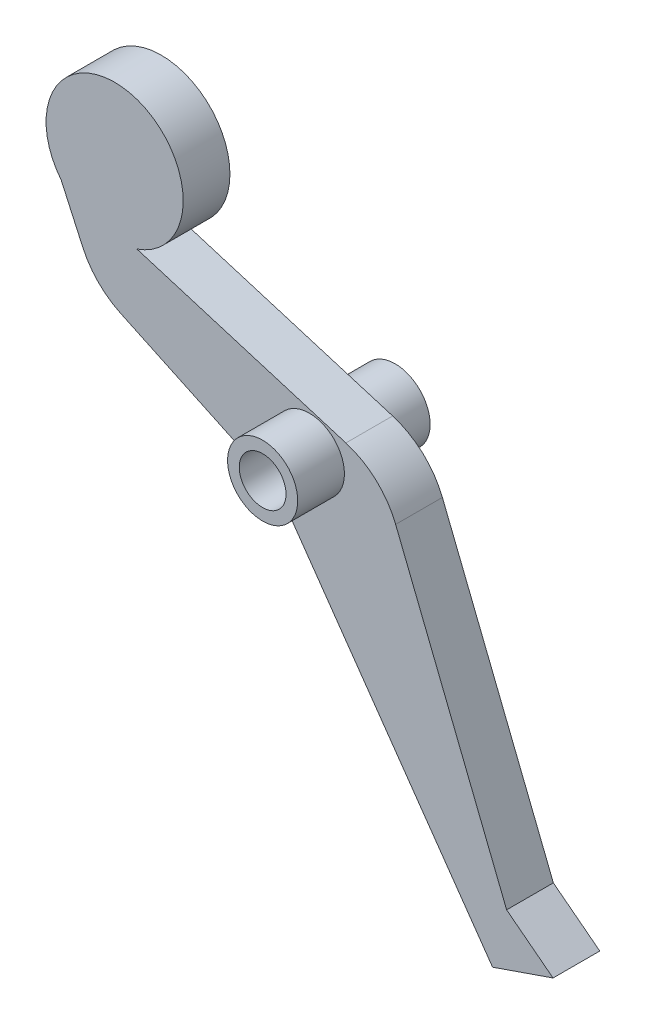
ISO-10303-21;
HEADER;
FILE_DESCRIPTION(('STEP AP214'),'2;1');
FILE_NAME('part.step','',(''),(''),'','','');
FILE_SCHEMA(('AUTOMOTIVE_DESIGN { 1 0 10303 214 1 1 1 1 }'));
ENDSEC;
DATA;
#1=APPLICATION_CONTEXT('core data for automotive mechanical design processes');
#2=APPLICATION_PROTOCOL_DEFINITION('international standard','automotive_design',2000,#1);
#3=PRODUCT_CONTEXT('',#1,'mechanical');
#4=PRODUCT('Part','Part','',(#3));
#5=PRODUCT_RELATED_PRODUCT_CATEGORY('part','',(#4));
#6=PRODUCT_DEFINITION_FORMATION('','',#4);
#7=PRODUCT_DEFINITION_CONTEXT('part definition',#1,'design');
#8=PRODUCT_DEFINITION('design','',#6,#7);
#9=PRODUCT_DEFINITION_SHAPE('','',#8);
#10=(LENGTH_UNIT() NAMED_UNIT(*) SI_UNIT(.MILLI.,.METRE.));
#11=(NAMED_UNIT(*) PLANE_ANGLE_UNIT() SI_UNIT($,.RADIAN.));
#12=(NAMED_UNIT(*) SI_UNIT($,.STERADIAN.) SOLID_ANGLE_UNIT());
#13=UNCERTAINTY_MEASURE_WITH_UNIT(LENGTH_MEASURE(1.E-05),#10,'distance_accuracy_value','');
#14=(GEOMETRIC_REPRESENTATION_CONTEXT(3) GLOBAL_UNCERTAINTY_ASSIGNED_CONTEXT((#13)) GLOBAL_UNIT_ASSIGNED_CONTEXT((#10,
#11,#12)) REPRESENTATION_CONTEXT('',''));
#15=CARTESIAN_POINT('',(0.,0.,0.));
#16=DIRECTION('',(0.,0.,1.));
#17=DIRECTION('',(1.,0.,0.));
#18=AXIS2_PLACEMENT_3D('',#15,#16,#17);
#19=CARTESIAN_POINT('',(176.30998455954,-47.4739661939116,-6.));
#20=DIRECTION('',(0.32629419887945,-0.945268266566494,0.));
#21=DIRECTION('',(0.945268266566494,0.32629419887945,0.));
#22=AXIS2_PLACEMENT_3D('',#19,#20,#21);
#23=PLANE('',#22);
#24=DIRECTION('',(0.945268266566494,0.32629419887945,0.));
#25=VECTOR('',#24,1.);
#26=CARTESIAN_POINT('',(176.30998455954,-47.4739661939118,0.));
#27=LINE('',#26,#25);
#28=CARTESIAN_POINT('',(176.30998455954,-47.4739661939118,0.));
#29=VERTEX_POINT('',#28);
#30=CARTESIAN_POINT('',(184.073286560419,-44.7941762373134,0.));
#31=VERTEX_POINT('',#30);
#32=EDGE_CURVE('E746',#29,#31,#27,.T.);
#33=ORIENTED_EDGE('',*,*,#32,.F.);
#34=DIRECTION('',(0.,0.,0.999999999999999));
#35=VECTOR('',#34,1.);
#36=CARTESIAN_POINT('',(176.30998455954,-47.4739661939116,-6.));
#37=LINE('',#36,#35);
#38=CARTESIAN_POINT('',(176.30998455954,-47.4739661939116,-6.));
#39=VERTEX_POINT('',#38);
#40=EDGE_CURVE('E669',#39,#29,#37,.T.);
#41=ORIENTED_EDGE('',*,*,#40,.F.);
#42=DIRECTION('',(0.945268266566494,0.32629419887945,0.));
#43=VECTOR('',#42,1.);
#44=CARTESIAN_POINT('',(176.30998455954,-47.4739661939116,-6.));
#45=LINE('',#44,#43);
#46=CARTESIAN_POINT('',(184.073286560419,-44.7941762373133,-6.));
#47=VERTEX_POINT('',#46);
#48=EDGE_CURVE('E748',#39,#47,#45,.T.);
#49=ORIENTED_EDGE('',*,*,#48,.T.);
#50=DIRECTION('',(0.,0.,0.999999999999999));
#51=VECTOR('',#50,1.);
#52=CARTESIAN_POINT('',(184.073286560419,-44.7941762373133,-6.));
#53=LINE('',#52,#51);
#54=EDGE_CURVE('E743',#47,#31,#53,.T.);
#55=ORIENTED_EDGE('',*,*,#54,.T.);
#56=EDGE_LOOP('',(#33,#41,#49,#55));
#57=FACE_BOUND('',#56,.T.);
#58=ADVANCED_FACE('F661',(#57),#23,.T.);
#59=CARTESIAN_POINT('',(150.322061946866,-10.353529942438,-6.));
#60=DIRECTION('',(-0.819194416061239,-0.573515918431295,0.));
#61=DIRECTION('',(0.573515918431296,-0.819194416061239,0.));
#62=AXIS2_PLACEMENT_3D('',#59,#60,#61);
#63=PLANE('',#62);
#64=DIRECTION('',(0.573515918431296,-0.819194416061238,0.));
#65=VECTOR('',#64,1.);
#66=CARTESIAN_POINT('',(150.322061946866,-10.3535299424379,0.));
#67=LINE('',#66,#65);
#68=CARTESIAN_POINT('',(150.322061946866,-10.3535299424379,0.));
#69=VERTEX_POINT('',#68);
#70=EDGE_CURVE('E764',#69,#29,#67,.T.);
#71=ORIENTED_EDGE('',*,*,#70,.F.);
#72=DIRECTION('',(0.,0.,0.999999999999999));
#73=VECTOR('',#72,1.);
#74=CARTESIAN_POINT('',(150.322061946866,-10.353529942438,-6.));
#75=LINE('',#74,#73);
#76=CARTESIAN_POINT('',(150.322061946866,-10.353529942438,-6.));
#77=VERTEX_POINT('',#76);
#78=EDGE_CURVE('E684',#77,#69,#75,.T.);
#79=ORIENTED_EDGE('',*,*,#78,.F.);
#80=DIRECTION('',(0.573515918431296,-0.819194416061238,0.));
#81=VECTOR('',#80,1.);
#82=CARTESIAN_POINT('',(150.322061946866,-10.353529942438,-6.));
#83=LINE('',#82,#81);
#84=EDGE_CURVE('E753',#77,#39,#83,.T.);
#85=ORIENTED_EDGE('',*,*,#84,.T.);
#86=ORIENTED_EDGE('',*,*,#40,.T.);
#87=EDGE_LOOP('',(#71,#79,#85,#86));
#88=FACE_BOUND('',#87,.T.);
#89=ADVANCED_FACE('F866',(#88),#63,.T.);
#90=CARTESIAN_POINT('',(142.130117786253,-16.0886891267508,-5.99999999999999));
#91=DIRECTION('',(0.,0.,0.999999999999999));
#92=DIRECTION('',(1.,0.,0.));
#93=AXIS2_PLACEMENT_3D('',#90,#91,#92);
#94=CYLINDRICAL_SURFACE('',#93,9.99999999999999);
#95=CARTESIAN_POINT('',(142.130117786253,-16.0886891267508,0.));
#96=DIRECTION('',(0.,0.,-0.999999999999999));
#97=DIRECTION('',(1.,0.,0.));
#98=AXIS2_PLACEMENT_3D('',#95,#96,#97);
#99=CIRCLE('',#98,9.99999999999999);
#100=CARTESIAN_POINT('',(146.385172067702,-7.03913040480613,0.));
#101=VERTEX_POINT('',#100);
#102=EDGE_CURVE('E789',#101,#69,#99,.T.);
#103=ORIENTED_EDGE('',*,*,#102,.F.);
#104=DIRECTION('',(0.,0.,0.999999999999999));
#105=VECTOR('',#104,1.);
#106=CARTESIAN_POINT('',(146.385172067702,-7.03913040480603,-6.));
#107=LINE('',#106,#105);
#108=CARTESIAN_POINT('',(146.385172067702,-7.03913040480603,-6.));
#109=VERTEX_POINT('',#108);
#110=EDGE_CURVE('E821',#109,#101,#107,.T.);
#111=ORIENTED_EDGE('',*,*,#110,.F.);
#112=CARTESIAN_POINT('',(142.130117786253,-16.0886891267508,-5.99999999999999));
#113=DIRECTION('',(0.,0.,-0.999999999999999));
#114=DIRECTION('',(1.,0.,0.));
#115=AXIS2_PLACEMENT_3D('',#112,#113,#114);
#116=CIRCLE('',#115,9.99999999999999);
#117=EDGE_CURVE('E816',#109,#77,#116,.T.);
#118=ORIENTED_EDGE('',*,*,#117,.T.);
#119=ORIENTED_EDGE('',*,*,#78,.T.);
#120=EDGE_LOOP('',(#103,#111,#118,#119));
#121=FACE_BOUND('',#120,.T.);
#122=ADVANCED_FACE('F865',(#121),#94,.F.);
#123=CARTESIAN_POINT('',(128.550947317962,1.34642702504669,-6.));
#124=DIRECTION('',(-0.425505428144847,-0.904955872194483,0.));
#125=DIRECTION('',(0.904955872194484,-0.425505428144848,0.));
#126=AXIS2_PLACEMENT_3D('',#123,#124,#125);
#127=PLANE('',#126);
#128=DIRECTION('',(0.904955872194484,-0.425505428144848,0.));
#129=VECTOR('',#128,1.);
#130=CARTESIAN_POINT('',(128.550947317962,1.34642702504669,0.));
#131=LINE('',#130,#129);
#132=CARTESIAN_POINT('',(128.550947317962,1.34642702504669,0.));
#133=VERTEX_POINT('',#132);
#134=EDGE_CURVE('E786',#133,#101,#131,.T.);
#135=ORIENTED_EDGE('',*,*,#134,.F.);
#136=DIRECTION('',(0.,0.,0.999999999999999));
#137=VECTOR('',#136,1.);
#138=CARTESIAN_POINT('',(128.550947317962,1.34642702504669,-6.));
#139=LINE('',#138,#137);
#140=CARTESIAN_POINT('',(128.550947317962,1.34642702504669,-6.));
#141=VERTEX_POINT('',#140);
#142=EDGE_CURVE('E823',#141,#133,#139,.T.);
#143=ORIENTED_EDGE('',*,*,#142,.F.);
#144=DIRECTION('',(0.904955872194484,-0.425505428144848,0.));
#145=VECTOR('',#144,1.);
#146=CARTESIAN_POINT('',(128.550947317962,1.34642702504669,-6.));
#147=LINE('',#146,#145);
#148=EDGE_CURVE('E813',#141,#109,#147,.T.);
#149=ORIENTED_EDGE('',*,*,#148,.T.);
#150=ORIENTED_EDGE('',*,*,#110,.T.);
#151=EDGE_LOOP('',(#135,#143,#149,#150));
#152=FACE_BOUND('',#151,.T.);
#153=ADVANCED_FACE('F861',(#152),#127,.T.);
#154=CARTESIAN_POINT('',(132.806001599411,10.3959857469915,-6.));
#155=DIRECTION('',(0.,0.,0.999999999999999));
#156=DIRECTION('',(1.,0.,0.));
#157=AXIS2_PLACEMENT_3D('',#154,#155,#156);
#158=CYLINDRICAL_SURFACE('',#157,10.);
#159=CARTESIAN_POINT('',(132.806001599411,10.3959857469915,0.));
#160=DIRECTION('',(0.,0.,0.999999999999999));
#161=DIRECTION('',(-1.,0.,0.));
#162=AXIS2_PLACEMENT_3D('',#159,#160,#161);
#163=CIRCLE('',#162,10.);
#164=CARTESIAN_POINT('',(123.704184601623,6.2538936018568,0.));
#165=VERTEX_POINT('',#164);
#166=EDGE_CURVE('E783',#165,#133,#163,.T.);
#167=ORIENTED_EDGE('',*,*,#166,.F.);
#168=DIRECTION('',(0.,0.,0.999999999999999));
#169=VECTOR('',#168,1.);
#170=CARTESIAN_POINT('',(123.704184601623,6.25389360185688,-5.99999999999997));
#171=LINE('',#170,#169);
#172=CARTESIAN_POINT('',(123.704184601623,6.25389360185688,-5.99999999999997));
#173=VERTEX_POINT('',#172);
#174=EDGE_CURVE('E825',#173,#165,#171,.T.);
#175=ORIENTED_EDGE('',*,*,#174,.F.);
#176=CARTESIAN_POINT('',(132.806001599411,10.3959857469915,-6.));
#177=DIRECTION('',(0.,0.,0.999999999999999));
#178=DIRECTION('',(-1.,0.,0.));
#179=AXIS2_PLACEMENT_3D('',#176,#177,#178);
#180=CIRCLE('',#179,10.);
#181=EDGE_CURVE('E810',#173,#141,#180,.T.);
#182=ORIENTED_EDGE('',*,*,#181,.T.);
#183=ORIENTED_EDGE('',*,*,#142,.T.);
#184=EDGE_LOOP('',(#167,#175,#182,#183));
#185=FACE_BOUND('',#184,.T.);
#186=ADVANCED_FACE('F857',(#185),#158,.T.);
#187=CARTESIAN_POINT('',(120.929806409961,12.3503013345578,-5.99999999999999));
#188=DIRECTION('',(-0.910181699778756,-0.414209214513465,0.));
#189=DIRECTION('',(0.414209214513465,-0.910181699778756,0.));
#190=AXIS2_PLACEMENT_3D('',#187,#188,#189);
#191=PLANE('',#190);
#192=DIRECTION('',(0.414209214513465,-0.910181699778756,0.));
#193=VECTOR('',#192,1.);
#194=CARTESIAN_POINT('',(120.929806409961,12.3503013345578,0.));
#195=LINE('',#194,#193);
#196=CARTESIAN_POINT('',(120.929806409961,12.3503013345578,0.));
#197=VERTEX_POINT('',#196);
#198=EDGE_CURVE('E780',#197,#165,#195,.T.);
#199=ORIENTED_EDGE('',*,*,#198,.F.);
#200=DIRECTION('',(0.,0.,0.999999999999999));
#201=VECTOR('',#200,1.);
#202=CARTESIAN_POINT('',(120.929806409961,12.3503013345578,-5.99999999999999));
#203=LINE('',#202,#201);
#204=CARTESIAN_POINT('',(120.929806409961,12.3503013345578,-5.99999999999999));
#205=VERTEX_POINT('',#204);
#206=EDGE_CURVE('E827',#205,#197,#203,.T.);
#207=ORIENTED_EDGE('',*,*,#206,.F.);
#208=DIRECTION('',(0.414209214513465,-0.910181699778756,0.));
#209=VECTOR('',#208,1.);
#210=CARTESIAN_POINT('',(120.929806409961,12.3503013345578,-5.99999999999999));
#211=LINE('',#210,#209);
#212=EDGE_CURVE('E807',#205,#173,#211,.T.);
#213=ORIENTED_EDGE('',*,*,#212,.T.);
#214=ORIENTED_EDGE('',*,*,#174,.T.);
#215=EDGE_LOOP('',(#199,#207,#213,#214));
#216=FACE_BOUND('',#215,.T.);
#217=ADVANCED_FACE('F853',(#216),#191,.T.);
#218=CARTESIAN_POINT('',(127.791711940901,17.8597706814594,-5.99999999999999));
#219=DIRECTION('',(0.,0.,0.999999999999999));
#220=DIRECTION('',(1.,0.,0.));
#221=AXIS2_PLACEMENT_3D('',#218,#219,#220);
#222=CYLINDRICAL_SURFACE('',#221,8.8000000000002);
#223=CARTESIAN_POINT('',(127.791711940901,17.8597706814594,0.));
#224=DIRECTION('',(0.,0.,0.999999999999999));
#225=DIRECTION('',(1.,0.,0.));
#226=AXIS2_PLACEMENT_3D('',#223,#224,#225);
#227=CIRCLE('',#226,8.8000000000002);
#228=CARTESIAN_POINT('',(130.653762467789,9.53819229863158,0.));
#229=VERTEX_POINT('',#228);
#230=EDGE_CURVE('E777',#229,#197,#227,.T.);
#231=ORIENTED_EDGE('',*,*,#230,.F.);
#232=DIRECTION('',(0.,0.,0.999999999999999));
#233=VECTOR('',#232,1.);
#234=CARTESIAN_POINT('',(130.653762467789,9.53819229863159,-5.99999999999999));
#235=LINE('',#234,#233);
#236=CARTESIAN_POINT('',(130.653762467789,9.53819229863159,-5.99999999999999));
#237=VERTEX_POINT('',#236);
#238=EDGE_CURVE('E829',#237,#229,#235,.T.);
#239=ORIENTED_EDGE('',*,*,#238,.F.);
#240=CARTESIAN_POINT('',(127.791711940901,17.8597706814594,-5.99999999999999));
#241=DIRECTION('',(0.,0.,0.999999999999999));
#242=DIRECTION('',(1.,0.,0.));
#243=AXIS2_PLACEMENT_3D('',#240,#241,#242);
#244=CIRCLE('',#243,8.8000000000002);
#245=EDGE_CURVE('E804',#237,#205,#244,.T.);
#246=ORIENTED_EDGE('',*,*,#245,.T.);
#247=ORIENTED_EDGE('',*,*,#206,.T.);
#248=EDGE_LOOP('',(#231,#239,#246,#247));
#249=FACE_BOUND('',#248,.T.);
#250=ADVANCED_FACE('F849',(#249),#222,.T.);
#251=CARTESIAN_POINT('',(157.481200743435,1.3969087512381,-5.99999999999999));
#252=DIRECTION('',(0.290391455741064,0.956907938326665,0.));
#253=DIRECTION('',(-0.956907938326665,0.290391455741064,0.));
#254=AXIS2_PLACEMENT_3D('',#251,#252,#253);
#255=PLANE('',#254);
#256=DIRECTION('',(-0.956907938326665,0.290391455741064,0.));
#257=VECTOR('',#256,1.);
#258=CARTESIAN_POINT('',(157.481200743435,1.39690875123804,0.));
#259=LINE('',#258,#257);
#260=CARTESIAN_POINT('',(157.481200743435,1.39690875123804,0.));
#261=VERTEX_POINT('',#260);
#262=EDGE_CURVE('E774',#261,#229,#259,.T.);
#263=ORIENTED_EDGE('',*,*,#262,.F.);
#264=DIRECTION('',(0.,0.,0.999999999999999));
#265=VECTOR('',#264,1.);
#266=CARTESIAN_POINT('',(157.481200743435,1.3969087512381,-5.99999999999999));
#267=LINE('',#266,#265);
#268=CARTESIAN_POINT('',(157.481200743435,1.3969087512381,-5.99999999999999));
#269=VERTEX_POINT('',#268);
#270=EDGE_CURVE('E831',#269,#261,#267,.T.);
#271=ORIENTED_EDGE('',*,*,#270,.F.);
#272=DIRECTION('',(-0.956907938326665,0.290391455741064,0.));
#273=VECTOR('',#272,1.);
#274=CARTESIAN_POINT('',(157.481200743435,1.3969087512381,-5.99999999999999));
#275=LINE('',#274,#273);
#276=EDGE_CURVE('E801',#269,#237,#275,.T.);
#277=ORIENTED_EDGE('',*,*,#276,.T.);
#278=ORIENTED_EDGE('',*,*,#238,.T.);
#279=EDGE_LOOP('',(#263,#271,#277,#278));
#280=FACE_BOUND('',#279,.T.);
#281=ADVANCED_FACE('F845',(#280),#255,.T.);
#282=CARTESIAN_POINT('',(154.577286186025,-8.17217063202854,-6.));
#283=DIRECTION('',(0.,0.,0.999999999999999));
#284=DIRECTION('',(1.,0.,0.));
#285=AXIS2_PLACEMENT_3D('',#282,#283,#284);
#286=CYLINDRICAL_SURFACE('',#285,10.);
#287=CARTESIAN_POINT('',(154.577286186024,-8.17217063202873,0.));
#288=DIRECTION('',(0.,0.,0.999999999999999));
#289=DIRECTION('',(-1.,0.,0.));
#290=AXIS2_PLACEMENT_3D('',#287,#288,#289);
#291=CIRCLE('',#290,10.);
#292=CARTESIAN_POINT('',(163.866062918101,-4.46830416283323,0.));
#293=VERTEX_POINT('',#292);
#294=EDGE_CURVE('E771',#293,#261,#291,.T.);
#295=ORIENTED_EDGE('',*,*,#294,.F.);
#296=DIRECTION('',(0.,0.,0.999999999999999));
#297=VECTOR('',#296,1.);
#298=CARTESIAN_POINT('',(163.866062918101,-4.46830416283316,-5.99999999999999));
#299=LINE('',#298,#297);
#300=CARTESIAN_POINT('',(163.866062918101,-4.46830416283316,-5.99999999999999));
#301=VERTEX_POINT('',#300);
#302=EDGE_CURVE('E833',#301,#293,#299,.T.);
#303=ORIENTED_EDGE('',*,*,#302,.F.);
#304=CARTESIAN_POINT('',(154.577286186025,-8.17217063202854,-6.));
#305=DIRECTION('',(0.,0.,0.999999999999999));
#306=DIRECTION('',(-1.,0.,0.));
#307=AXIS2_PLACEMENT_3D('',#304,#305,#306);
#308=CIRCLE('',#307,10.);
#309=EDGE_CURVE('E798',#301,#269,#308,.T.);
#310=ORIENTED_EDGE('',*,*,#309,.T.);
#311=ORIENTED_EDGE('',*,*,#270,.T.);
#312=EDGE_LOOP('',(#295,#303,#310,#311));
#313=FACE_BOUND('',#312,.T.);
#314=ADVANCED_FACE('F841',(#313),#286,.T.);
#315=CARTESIAN_POINT('',(178.113332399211,-40.1984543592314,-5.99999999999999));
#316=DIRECTION('',(0.928877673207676,0.370386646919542,0.));
#317=DIRECTION('',(-0.370386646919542,0.928877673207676,0.));
#318=AXIS2_PLACEMENT_3D('',#315,#316,#317);
#319=PLANE('',#318);
#320=DIRECTION('',(-0.370386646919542,0.928877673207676,0.));
#321=VECTOR('',#320,1.);
#322=CARTESIAN_POINT('',(178.113332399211,-40.1984543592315,0.));
#323=LINE('',#322,#321);
#324=CARTESIAN_POINT('',(178.113332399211,-40.1984543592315,0.));
#325=VERTEX_POINT('',#324);
#326=EDGE_CURVE('E760',#325,#293,#323,.T.);
#327=ORIENTED_EDGE('',*,*,#326,.F.);
#328=DIRECTION('',(0.,0.,0.999999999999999));
#329=VECTOR('',#328,1.);
#330=CARTESIAN_POINT('',(178.113332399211,-40.1984543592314,-5.99999999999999));
#331=LINE('',#330,#329);
#332=CARTESIAN_POINT('',(178.113332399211,-40.1984543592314,-5.99999999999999));
#333=VERTEX_POINT('',#332);
#334=EDGE_CURVE('E752',#333,#325,#331,.T.);
#335=ORIENTED_EDGE('',*,*,#334,.F.);
#336=DIRECTION('',(-0.370386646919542,0.928877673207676,0.));
#337=VECTOR('',#336,1.);
#338=CARTESIAN_POINT('',(178.113332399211,-40.1984543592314,-5.99999999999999));
#339=LINE('',#338,#337);
#340=EDGE_CURVE('E795',#333,#301,#339,.T.);
#341=ORIENTED_EDGE('',*,*,#340,.T.);
#342=ORIENTED_EDGE('',*,*,#302,.T.);
#343=EDGE_LOOP('',(#327,#335,#341,#342));
#344=FACE_BOUND('',#343,.T.);
#345=ADVANCED_FACE('F837',(#344),#319,.T.);
#346=CARTESIAN_POINT('',(184.073286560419,-44.7941762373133,-6.));
#347=DIRECTION('',(0.610640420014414,0.791907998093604,0.));
#348=DIRECTION('',(-0.791907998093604,0.610640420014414,0.));
#349=AXIS2_PLACEMENT_3D('',#346,#347,#348);
#350=PLANE('',#349);
#351=DIRECTION('',(-0.791907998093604,0.610640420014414,0.));
#352=VECTOR('',#351,1.);
#353=CARTESIAN_POINT('',(184.073286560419,-44.7941762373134,0.));
#354=LINE('',#353,#352);
#355=EDGE_CURVE('E755',#31,#325,#354,.T.);
#356=ORIENTED_EDGE('',*,*,#355,.F.);
#357=ORIENTED_EDGE('',*,*,#54,.F.);
#358=DIRECTION('',(-0.791907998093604,0.610640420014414,0.));
#359=VECTOR('',#358,1.);
#360=CARTESIAN_POINT('',(184.073286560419,-44.7941762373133,-6.));
#361=LINE('',#360,#359);
#362=EDGE_CURVE('E793',#47,#333,#361,.T.);
#363=ORIENTED_EDGE('',*,*,#362,.T.);
#364=ORIENTED_EDGE('',*,*,#334,.T.);
#365=EDGE_LOOP('',(#356,#357,#363,#364));
#366=FACE_BOUND('',#365,.T.);
#367=ADVANCED_FACE('F756',(#366),#350,.T.);
#368=CARTESIAN_POINT('',(154.577286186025,-8.17217063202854,-6.));
#369=DIRECTION('',(0.,0.,-0.999999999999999));
#370=DIRECTION('',(-1.,0.,0.));
#371=AXIS2_PLACEMENT_3D('',#368,#369,#370);
#372=PLANE('',#371);
#373=CARTESIAN_POINT('',(152.791711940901,-2.14022931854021,-6.));
#374=DIRECTION('',(0.,0.,-0.999999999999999));
#375=DIRECTION('',(-1.,0.,0.));
#376=AXIS2_PLACEMENT_3D('',#373,#374,#375);
#377=CIRCLE('',#376,4.49999999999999);
#378=CARTESIAN_POINT('',(157.291711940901,-2.14022931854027,-6.));
#379=VERTEX_POINT('',#378);
#380=EDGE_CURVE('E12',#379,#379,#377,.T.);
#381=ORIENTED_EDGE('',*,*,#380,.F.);
#382=EDGE_LOOP('',(#381));
#383=FACE_BOUND('',#382,.T.);
#384=ORIENTED_EDGE('',*,*,#48,.F.);
#385=ORIENTED_EDGE('',*,*,#84,.F.);
#386=ORIENTED_EDGE('',*,*,#117,.F.);
#387=ORIENTED_EDGE('',*,*,#148,.F.);
#388=ORIENTED_EDGE('',*,*,#181,.F.);
#389=ORIENTED_EDGE('',*,*,#212,.F.);
#390=ORIENTED_EDGE('',*,*,#245,.F.);
#391=ORIENTED_EDGE('',*,*,#276,.F.);
#392=ORIENTED_EDGE('',*,*,#309,.F.);
#393=ORIENTED_EDGE('',*,*,#340,.F.);
#394=ORIENTED_EDGE('',*,*,#362,.F.);
#395=EDGE_LOOP('',(#384,#385,#386,#387,#388,#389,#390,#391,#392,#393,#394));
#396=FACE_BOUND('',#395,.T.);
#397=ADVANCED_FACE('F869',(#383,#396),#372,.T.);
#398=CARTESIAN_POINT('',(154.577286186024,-8.17217063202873,0.));
#399=DIRECTION('',(0.,0.,-0.999999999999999));
#400=DIRECTION('',(-1.,0.,0.));
#401=AXIS2_PLACEMENT_3D('',#398,#399,#400);
#402=PLANE('',#401);
#403=CARTESIAN_POINT('',(152.791711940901,-2.14022931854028,0.));
#404=DIRECTION('',(0.,0.,-0.999999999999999));
#405=DIRECTION('',(-1.,0.,0.));
#406=AXIS2_PLACEMENT_3D('',#403,#404,#405);
#407=CIRCLE('',#406,4.49999999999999);
#408=CARTESIAN_POINT('',(157.291711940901,-2.14022931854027,0.));
#409=VERTEX_POINT('',#408);
#410=EDGE_CURVE('E664',#409,#409,#407,.T.);
#411=ORIENTED_EDGE('',*,*,#410,.T.);
#412=EDGE_LOOP('',(#411));
#413=FACE_BOUND('',#412,.T.);
#414=ORIENTED_EDGE('',*,*,#32,.T.);
#415=ORIENTED_EDGE('',*,*,#355,.T.);
#416=ORIENTED_EDGE('',*,*,#326,.T.);
#417=ORIENTED_EDGE('',*,*,#294,.T.);
#418=ORIENTED_EDGE('',*,*,#262,.T.);
#419=ORIENTED_EDGE('',*,*,#230,.T.);
#420=ORIENTED_EDGE('',*,*,#198,.T.);
#421=ORIENTED_EDGE('',*,*,#166,.T.);
#422=ORIENTED_EDGE('',*,*,#134,.T.);
#423=ORIENTED_EDGE('',*,*,#102,.T.);
#424=ORIENTED_EDGE('',*,*,#70,.T.);
#425=EDGE_LOOP('',(#414,#415,#416,#417,#418,#419,#420,#421,#422,#423,#424));
#426=FACE_BOUND('',#425,.T.);
#427=ADVANCED_FACE('F762',(#413,#426),#402,.F.);
#428=CARTESIAN_POINT('',(152.791711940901,-2.14022931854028,-10.9999999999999));
#429=DIRECTION('',(0.,0.,0.999999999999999));
#430=DIRECTION('',(1.,0.,0.));
#431=AXIS2_PLACEMENT_3D('',#428,#429,#430);
#432=CYLINDRICAL_SURFACE('',#431,4.49999999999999);
#433=CARTESIAN_POINT('',(152.791711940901,-2.14022931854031,6.00000000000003));
#434=DIRECTION('',(0.,0.,0.999999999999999));
#435=DIRECTION('',(1.,0.,0.));
#436=AXIS2_PLACEMENT_3D('',#433,#434,#435);
#437=CIRCLE('',#436,4.49999999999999);
#438=CARTESIAN_POINT('',(157.291711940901,-2.14022931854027,6.00000000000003));
#439=VERTEX_POINT('',#438);
#440=EDGE_CURVE('E968',#439,#439,#437,.T.);
#441=CARTESIAN_POINT('',(157.291711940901,-2.14022931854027,6.00000000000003));
#442=CARTESIAN_POINT('',(157.291711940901,-2.14022931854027,5.93750000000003));
#443=CARTESIAN_POINT('',(157.291711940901,-2.14022931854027,5.87500000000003));
#444=CARTESIAN_POINT('',(157.291711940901,-2.14022931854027,5.75000000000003));
#445=CARTESIAN_POINT('',(157.291711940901,-2.14022931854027,5.68750000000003));
#446=CARTESIAN_POINT('',(157.291711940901,-2.14022931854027,5.56250000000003));
#447=CARTESIAN_POINT('',(157.291711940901,-2.14022931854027,5.50000000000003));
#448=CARTESIAN_POINT('',(157.291711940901,-2.14022931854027,5.37500000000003));
#449=CARTESIAN_POINT('',(157.291711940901,-2.14022931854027,5.31250000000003));
#450=CARTESIAN_POINT('',(157.291711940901,-2.14022931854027,5.18750000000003));
#451=CARTESIAN_POINT('',(157.291711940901,-2.14022931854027,5.12500000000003));
#452=CARTESIAN_POINT('',(157.291711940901,-2.14022931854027,5.00000000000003));
#453=CARTESIAN_POINT('',(157.291711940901,-2.14022931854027,4.93750000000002));
#454=CARTESIAN_POINT('',(157.291711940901,-2.14022931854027,4.81250000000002));
#455=CARTESIAN_POINT('',(157.291711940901,-2.14022931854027,4.75000000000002));
#456=CARTESIAN_POINT('',(157.291711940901,-2.14022931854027,4.62500000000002));
#457=CARTESIAN_POINT('',(157.291711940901,-2.14022931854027,4.56250000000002));
#458=CARTESIAN_POINT('',(157.291711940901,-2.14022931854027,4.43750000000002));
#459=CARTESIAN_POINT('',(157.291711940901,-2.14022931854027,4.37500000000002));
#460=CARTESIAN_POINT('',(157.291711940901,-2.14022931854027,4.25000000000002));
#461=CARTESIAN_POINT('',(157.291711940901,-2.14022931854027,4.18750000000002));
#462=CARTESIAN_POINT('',(157.291711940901,-2.14022931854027,4.06250000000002));
#463=CARTESIAN_POINT('',(157.291711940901,-2.14022931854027,4.00000000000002));
#464=CARTESIAN_POINT('',(157.291711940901,-2.14022931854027,3.87500000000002));
#465=CARTESIAN_POINT('',(157.291711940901,-2.14022931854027,3.81250000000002));
#466=CARTESIAN_POINT('',(157.291711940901,-2.14022931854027,3.68750000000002));
#467=CARTESIAN_POINT('',(157.291711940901,-2.14022931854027,3.62500000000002));
#468=CARTESIAN_POINT('',(157.291711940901,-2.14022931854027,3.50000000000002));
#469=CARTESIAN_POINT('',(157.291711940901,-2.14022931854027,3.43750000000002));
#470=CARTESIAN_POINT('',(157.291711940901,-2.14022931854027,3.31250000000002));
#471=CARTESIAN_POINT('',(157.291711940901,-2.14022931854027,3.25000000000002));
#472=CARTESIAN_POINT('',(157.291711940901,-2.14022931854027,3.12500000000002));
#473=CARTESIAN_POINT('',(157.291711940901,-2.14022931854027,3.06250000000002));
#474=CARTESIAN_POINT('',(157.291711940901,-2.14022931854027,2.93750000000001));
#475=CARTESIAN_POINT('',(157.291711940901,-2.14022931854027,2.87500000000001));
#476=CARTESIAN_POINT('',(157.291711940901,-2.14022931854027,2.75000000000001));
#477=CARTESIAN_POINT('',(157.291711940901,-2.14022931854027,2.68750000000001));
#478=CARTESIAN_POINT('',(157.291711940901,-2.14022931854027,2.56250000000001));
#479=CARTESIAN_POINT('',(157.291711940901,-2.14022931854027,2.50000000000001));
#480=CARTESIAN_POINT('',(157.291711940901,-2.14022931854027,2.37500000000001));
#481=CARTESIAN_POINT('',(157.291711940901,-2.14022931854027,2.31250000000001));
#482=CARTESIAN_POINT('',(157.291711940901,-2.14022931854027,2.18750000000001));
#483=CARTESIAN_POINT('',(157.291711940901,-2.14022931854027,2.12500000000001));
#484=CARTESIAN_POINT('',(157.291711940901,-2.14022931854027,2.00000000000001));
#485=CARTESIAN_POINT('',(157.291711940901,-2.14022931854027,1.93750000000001));
#486=CARTESIAN_POINT('',(157.291711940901,-2.14022931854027,1.81250000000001));
#487=CARTESIAN_POINT('',(157.291711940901,-2.14022931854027,1.75000000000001));
#488=CARTESIAN_POINT('',(157.291711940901,-2.14022931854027,1.62500000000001));
#489=CARTESIAN_POINT('',(157.291711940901,-2.14022931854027,1.56250000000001));
#490=CARTESIAN_POINT('',(157.291711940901,-2.14022931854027,1.4375));
#491=CARTESIAN_POINT('',(157.291711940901,-2.14022931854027,1.375));
#492=CARTESIAN_POINT('',(157.291711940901,-2.14022931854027,1.25));
#493=CARTESIAN_POINT('',(157.291711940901,-2.14022931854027,1.1875));
#494=CARTESIAN_POINT('',(157.291711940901,-2.14022931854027,1.0625));
#495=CARTESIAN_POINT('',(157.291711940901,-2.14022931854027,1.));
#496=CARTESIAN_POINT('',(157.291711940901,-2.14022931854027,0.875000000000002));
#497=CARTESIAN_POINT('',(157.291711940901,-2.14022931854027,0.812500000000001));
#498=CARTESIAN_POINT('',(157.291711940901,-2.14022931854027,0.687500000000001));
#499=CARTESIAN_POINT('',(157.291711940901,-2.14022931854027,0.625000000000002));
#500=CARTESIAN_POINT('',(157.291711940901,-2.14022931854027,0.500000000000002));
#501=CARTESIAN_POINT('',(157.291711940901,-2.14022931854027,0.437500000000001));
#502=CARTESIAN_POINT('',(157.291711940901,-2.14022931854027,0.3125));
#503=CARTESIAN_POINT('',(157.291711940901,-2.14022931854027,0.249999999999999));
#504=CARTESIAN_POINT('',(157.291711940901,-2.14022931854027,0.124999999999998));
#505=CARTESIAN_POINT('',(157.291711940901,-2.14022931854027,0.0624999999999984));
#506=CARTESIAN_POINT('',(157.291711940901,-2.14022931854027,0.));
#507=B_SPLINE_CURVE_WITH_KNOTS('',3,(#441,#442,#443,#444,#445,#446,#447,#448,#449,#450,#451,
#452,#453,#454,#455,#456,#457,#458,#459,#460,#461,#462,#463,#464,#465,#466,#467,#468,#469,#470,
#471,#472,#473,#474,#475,#476,#477,#478,#479,#480,#481,#482,#483,#484,#485,#486,#487,#488,#489,
#490,#491,#492,#493,#494,#495,#496,#497,#498,#499,#500,#501,#502,#503,#504,#505,#506),
.UNSPECIFIED.,.F.,.F.,(4,2,2,2,2,2,2,2,2,2,2,2,2,2,2,2,2,2,2,2,2,2,2,2,2,2,2,2,2,2,2,2,4),(0.,
0.1875,0.375000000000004,0.562500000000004,0.750000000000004,0.937500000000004,1.12500000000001,
1.31250000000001,1.50000000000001,1.68750000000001,1.87500000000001,2.06250000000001,
2.25000000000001,2.43750000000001,2.62500000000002,2.81250000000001,3.00000000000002,
3.18750000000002,3.37500000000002,3.56250000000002,3.75000000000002,3.93750000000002,
4.12500000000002,4.31250000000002,4.50000000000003,4.68750000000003,4.87500000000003,
5.06250000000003,5.25000000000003,5.43750000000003,5.62500000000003,5.81250000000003,
6.00000000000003),.UNSPECIFIED.);
#508=EDGE_CURVE('BSEAM877',#439,#409,#507,.T.);
#509=ORIENTED_EDGE('',*,*,#440,.F.);
#510=ORIENTED_EDGE('',*,*,#410,.F.);
#511=ORIENTED_EDGE('',*,*,#508,.T.);
#512=ORIENTED_EDGE('',*,*,#508,.F.);
#513=EDGE_LOOP('',(#509,#511,#510,#512));
#514=FACE_BOUND('',#513,.T.);
#515=ADVANCED_FACE('F877',(#514),#432,.T.);
#516=CARTESIAN_POINT('',(152.791711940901,-2.14022931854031,6.00000000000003));
#517=DIRECTION('',(0.,0.,0.999999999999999));
#518=DIRECTION('',(1.,0.,0.));
#519=AXIS2_PLACEMENT_3D('',#516,#517,#518);
#520=PLANE('',#519);
#521=ORIENTED_EDGE('',*,*,#440,.T.);
#522=EDGE_LOOP('',(#521));
#523=FACE_BOUND('',#522,.T.);
#524=CARTESIAN_POINT('',(152.791711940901,-2.14022931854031,6.00000000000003));
#525=DIRECTION('',(0.,0.,0.999999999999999));
#526=DIRECTION('',(1.,0.,0.));
#527=AXIS2_PLACEMENT_3D('',#524,#525,#526);
#528=CIRCLE('',#527,3.00000000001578);
#529=CARTESIAN_POINT('',(155.791711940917,-2.14022931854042,6.00000000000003));
#530=VERTEX_POINT('',#529);
#531=EDGE_CURVE('E973',#530,#530,#528,.T.);
#532=ORIENTED_EDGE('',*,*,#531,.F.);
#533=EDGE_LOOP('',(#532));
#534=FACE_BOUND('',#533,.T.);
#535=ADVANCED_FACE('F937',(#523,#534),#520,.T.);
#536=CARTESIAN_POINT('',(152.791711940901,-2.14022931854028,-10.9999999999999));
#537=DIRECTION('',(0.,0.,0.999999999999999));
#538=DIRECTION('',(1.,0.,0.));
#539=AXIS2_PLACEMENT_3D('',#536,#537,#538);
#540=CIRCLE('',#539,4.49999999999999);
#541=CARTESIAN_POINT('',(157.291711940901,-2.14022931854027,-10.9999999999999));
#542=VERTEX_POINT('',#541);
#543=EDGE_CURVE('E767',#542,#542,#540,.T.);
#544=CARTESIAN_POINT('',(157.291711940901,-2.14022931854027,-6.));
#545=CARTESIAN_POINT('',(157.291711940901,-2.14022931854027,-6.05208333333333));
#546=CARTESIAN_POINT('',(157.291711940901,-2.14022931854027,-6.10416666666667));
#547=CARTESIAN_POINT('',(157.291711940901,-2.14022931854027,-6.20833333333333));
#548=CARTESIAN_POINT('',(157.291711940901,-2.14022931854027,-6.26041666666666));
#549=CARTESIAN_POINT('',(157.291711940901,-2.14022931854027,-6.36458333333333));
#550=CARTESIAN_POINT('',(157.291711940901,-2.14022931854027,-6.41666666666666));
#551=CARTESIAN_POINT('',(157.291711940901,-2.14022931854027,-6.52083333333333));
#552=CARTESIAN_POINT('',(157.291711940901,-2.14022931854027,-6.57291666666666));
#553=CARTESIAN_POINT('',(157.291711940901,-2.14022931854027,-6.67708333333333));
#554=CARTESIAN_POINT('',(157.291711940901,-2.14022931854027,-6.72916666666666));
#555=CARTESIAN_POINT('',(157.291711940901,-2.14022931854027,-6.83333333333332));
#556=CARTESIAN_POINT('',(157.291711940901,-2.14022931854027,-6.88541666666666));
#557=CARTESIAN_POINT('',(157.291711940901,-2.14022931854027,-6.98958333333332));
#558=CARTESIAN_POINT('',(157.291711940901,-2.14022931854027,-7.04166666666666));
#559=CARTESIAN_POINT('',(157.291711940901,-2.14022931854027,-7.14583333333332));
#560=CARTESIAN_POINT('',(157.291711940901,-2.14022931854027,-7.19791666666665));
#561=CARTESIAN_POINT('',(157.291711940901,-2.14022931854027,-7.30208333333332));
#562=CARTESIAN_POINT('',(157.291711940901,-2.14022931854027,-7.35416666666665));
#563=CARTESIAN_POINT('',(157.291711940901,-2.14022931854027,-7.45833333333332));
#564=CARTESIAN_POINT('',(157.291711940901,-2.14022931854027,-7.51041666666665));
#565=CARTESIAN_POINT('',(157.291711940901,-2.14022931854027,-7.61458333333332));
#566=CARTESIAN_POINT('',(157.291711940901,-2.14022931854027,-7.66666666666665));
#567=CARTESIAN_POINT('',(157.291711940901,-2.14022931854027,-7.77083333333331));
#568=CARTESIAN_POINT('',(157.291711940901,-2.14022931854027,-7.82291666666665));
#569=CARTESIAN_POINT('',(157.291711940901,-2.14022931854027,-7.92708333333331));
#570=CARTESIAN_POINT('',(157.291711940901,-2.14022931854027,-7.97916666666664));
#571=CARTESIAN_POINT('',(157.291711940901,-2.14022931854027,-8.08333333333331));
#572=CARTESIAN_POINT('',(157.291711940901,-2.14022931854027,-8.13541666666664));
#573=CARTESIAN_POINT('',(157.291711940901,-2.14022931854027,-8.23958333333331));
#574=CARTESIAN_POINT('',(157.291711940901,-2.14022931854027,-8.29166666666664));
#575=CARTESIAN_POINT('',(157.291711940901,-2.14022931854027,-8.39583333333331));
#576=CARTESIAN_POINT('',(157.291711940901,-2.14022931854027,-8.44791666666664));
#577=CARTESIAN_POINT('',(157.291711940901,-2.14022931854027,-8.55208333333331));
#578=CARTESIAN_POINT('',(157.291711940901,-2.14022931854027,-8.60416666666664));
#579=CARTESIAN_POINT('',(157.291711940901,-2.14022931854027,-8.7083333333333));
#580=CARTESIAN_POINT('',(157.291711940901,-2.14022931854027,-8.76041666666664));
#581=CARTESIAN_POINT('',(157.291711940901,-2.14022931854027,-8.8645833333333));
#582=CARTESIAN_POINT('',(157.291711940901,-2.14022931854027,-8.91666666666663));
#583=CARTESIAN_POINT('',(157.291711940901,-2.14022931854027,-9.0208333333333));
#584=CARTESIAN_POINT('',(157.291711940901,-2.14022931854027,-9.07291666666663));
#585=CARTESIAN_POINT('',(157.291711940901,-2.14022931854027,-9.1770833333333));
#586=CARTESIAN_POINT('',(157.291711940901,-2.14022931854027,-9.22916666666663));
#587=CARTESIAN_POINT('',(157.291711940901,-2.14022931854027,-9.3333333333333));
#588=CARTESIAN_POINT('',(157.291711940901,-2.14022931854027,-9.38541666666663));
#589=CARTESIAN_POINT('',(157.291711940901,-2.14022931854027,-9.48958333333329));
#590=CARTESIAN_POINT('',(157.291711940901,-2.14022931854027,-9.54166666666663));
#591=CARTESIAN_POINT('',(157.291711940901,-2.14022931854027,-9.64583333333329));
#592=CARTESIAN_POINT('',(157.291711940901,-2.14022931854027,-9.69791666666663));
#593=CARTESIAN_POINT('',(157.291711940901,-2.14022931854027,-9.80208333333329));
#594=CARTESIAN_POINT('',(157.291711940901,-2.14022931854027,-9.85416666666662));
#595=CARTESIAN_POINT('',(157.291711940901,-2.14022931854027,-9.95833333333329));
#596=CARTESIAN_POINT('',(157.291711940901,-2.14022931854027,-10.0104166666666));
#597=CARTESIAN_POINT('',(157.291711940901,-2.14022931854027,-10.1145833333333));
#598=CARTESIAN_POINT('',(157.291711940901,-2.14022931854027,-10.1666666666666));
#599=CARTESIAN_POINT('',(157.291711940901,-2.14022931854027,-10.2708333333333));
#600=CARTESIAN_POINT('',(157.291711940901,-2.14022931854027,-10.3229166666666));
#601=CARTESIAN_POINT('',(157.291711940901,-2.14022931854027,-10.4270833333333));
#602=CARTESIAN_POINT('',(157.291711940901,-2.14022931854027,-10.4791666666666));
#603=CARTESIAN_POINT('',(157.291711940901,-2.14022931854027,-10.5833333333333));
#604=CARTESIAN_POINT('',(157.291711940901,-2.14022931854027,-10.6354166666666));
#605=CARTESIAN_POINT('',(157.291711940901,-2.14022931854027,-10.7395833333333));
#606=CARTESIAN_POINT('',(157.291711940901,-2.14022931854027,-10.7916666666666));
#607=CARTESIAN_POINT('',(157.291711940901,-2.14022931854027,-10.8958333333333));
#608=CARTESIAN_POINT('',(157.291711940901,-2.14022931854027,-10.9479166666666));
#609=CARTESIAN_POINT('',(157.291711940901,-2.14022931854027,-10.9999999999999));
#610=B_SPLINE_CURVE_WITH_KNOTS('',3,(#544,#545,#546,#547,#548,#549,#550,#551,#552,#553,#554,
#555,#556,#557,#558,#559,#560,#561,#562,#563,#564,#565,#566,#567,#568,#569,#570,#571,#572,#573,
#574,#575,#576,#577,#578,#579,#580,#581,#582,#583,#584,#585,#586,#587,#588,#589,#590,#591,#592,
#593,#594,#595,#596,#597,#598,#599,#600,#601,#602,#603,#604,#605,#606,#607,#608,#609),
.UNSPECIFIED.,.F.,.F.,(4,2,2,2,2,2,2,2,2,2,2,2,2,2,2,2,2,2,2,2,2,2,2,2,2,2,2,2,2,2,2,2,4),(0.,
0.156249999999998,0.312499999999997,0.468749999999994,0.624999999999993,0.781249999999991,
0.93749999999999,1.09374999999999,1.24999999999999,1.40624999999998,1.56249999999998,
1.71874999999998,1.87499999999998,2.03124999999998,2.18749999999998,2.34374999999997,
2.49999999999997,2.65624999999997,2.81249999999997,2.96874999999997,3.12499999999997,
3.28124999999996,3.43749999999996,3.59374999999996,3.74999999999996,3.90624999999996,
4.06249999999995,4.21874999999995,4.37499999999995,4.53124999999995,4.68749999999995,
4.84374999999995,4.99999999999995),.UNSPECIFIED.);
#611=EDGE_CURVE('BSEAM940',#379,#542,#610,.T.);
#612=ORIENTED_EDGE('',*,*,#380,.T.);
#613=ORIENTED_EDGE('',*,*,#543,.T.);
#614=ORIENTED_EDGE('',*,*,#611,.T.);
#615=ORIENTED_EDGE('',*,*,#611,.F.);
#616=EDGE_LOOP('',(#612,#614,#613,#615));
#617=FACE_BOUND('',#616,.T.);
#618=ADVANCED_FACE('F940',(#617),#432,.T.);
#619=CARTESIAN_POINT('',(152.791711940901,-2.14022931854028,-10.9999999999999));
#620=DIRECTION('',(0.,0.,0.999999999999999));
#621=DIRECTION('',(1.,0.,0.));
#622=AXIS2_PLACEMENT_3D('',#619,#620,#621);
#623=PLANE('',#622);
#624=CARTESIAN_POINT('',(152.791711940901,-2.14022931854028,-10.9999999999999));
#625=DIRECTION('',(0.,0.,0.999999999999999));
#626=DIRECTION('',(1.,0.,0.));
#627=AXIS2_PLACEMENT_3D('',#624,#625,#626);
#628=CIRCLE('',#627,3.00000000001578);
#629=CARTESIAN_POINT('',(155.791711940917,-2.14022931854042,-10.9999999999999));
#630=VERTEX_POINT('',#629);
#631=EDGE_CURVE('E964',#630,#630,#628,.T.);
#632=ORIENTED_EDGE('',*,*,#631,.T.);
#633=EDGE_LOOP('',(#632));
#634=FACE_BOUND('',#633,.T.);
#635=ORIENTED_EDGE('',*,*,#543,.F.);
#636=EDGE_LOOP('',(#635));
#637=FACE_BOUND('',#636,.T.);
#638=ADVANCED_FACE('F928',(#634,#637),#623,.F.);
#639=CARTESIAN_POINT('',(152.791711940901,-2.14022931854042,-6.));
#640=DIRECTION('',(0.,0.,0.999999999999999));
#641=DIRECTION('',(1.,0.,0.));
#642=AXIS2_PLACEMENT_3D('',#639,#640,#641);
#643=CYLINDRICAL_SURFACE('',#642,3.0000000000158);
#644=CARTESIAN_POINT('',(155.791711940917,-2.14022931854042,6.00000000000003));
#645=CARTESIAN_POINT('',(155.791711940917,-2.14022931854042,5.8229166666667));
#646=CARTESIAN_POINT('',(155.791711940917,-2.14022931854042,5.64583333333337));
#647=CARTESIAN_POINT('',(155.791711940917,-2.14022931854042,5.2916666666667));
#648=CARTESIAN_POINT('',(155.791711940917,-2.14022931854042,5.11458333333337));
#649=CARTESIAN_POINT('',(155.791711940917,-2.14022931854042,4.7604166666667));
#650=CARTESIAN_POINT('',(155.791711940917,-2.14022931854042,4.58333333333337));
#651=CARTESIAN_POINT('',(155.791711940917,-2.14022931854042,4.2291666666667));
#652=CARTESIAN_POINT('',(155.791711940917,-2.14022931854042,4.05208333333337));
#653=CARTESIAN_POINT('',(155.791711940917,-2.14022931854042,3.6979166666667));
#654=CARTESIAN_POINT('',(155.791711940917,-2.14022931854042,3.52083333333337));
#655=CARTESIAN_POINT('',(155.791711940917,-2.14022931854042,3.1666666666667));
#656=CARTESIAN_POINT('',(155.791711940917,-2.14022931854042,2.98958333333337));
#657=CARTESIAN_POINT('',(155.791711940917,-2.14022931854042,2.6354166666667));
#658=CARTESIAN_POINT('',(155.791711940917,-2.14022931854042,2.45833333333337));
#659=CARTESIAN_POINT('',(155.791711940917,-2.14022931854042,2.10416666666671));
#660=CARTESIAN_POINT('',(155.791711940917,-2.14022931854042,1.92708333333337));
#661=CARTESIAN_POINT('',(155.791711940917,-2.14022931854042,1.57291666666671));
#662=CARTESIAN_POINT('',(155.791711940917,-2.14022931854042,1.39583333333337));
#663=CARTESIAN_POINT('',(155.791711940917,-2.14022931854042,1.04166666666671));
#664=CARTESIAN_POINT('',(155.791711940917,-2.14022931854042,0.864583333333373));
#665=CARTESIAN_POINT('',(155.791711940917,-2.14022931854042,0.510416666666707));
#666=CARTESIAN_POINT('',(155.791711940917,-2.14022931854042,0.333333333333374));
#667=CARTESIAN_POINT('',(155.791711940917,-2.14022931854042,-0.0208333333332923));
#668=CARTESIAN_POINT('',(155.791711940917,-2.14022931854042,-0.197916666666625));
#669=CARTESIAN_POINT('',(155.791711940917,-2.14022931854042,-0.552083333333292));
#670=CARTESIAN_POINT('',(155.791711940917,-2.14022931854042,-0.729166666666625));
#671=CARTESIAN_POINT('',(155.791711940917,-2.14022931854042,-1.08333333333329));
#672=CARTESIAN_POINT('',(155.791711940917,-2.14022931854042,-1.26041666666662));
#673=CARTESIAN_POINT('',(155.791711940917,-2.14022931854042,-1.61458333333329));
#674=CARTESIAN_POINT('',(155.791711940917,-2.14022931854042,-1.79166666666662));
#675=CARTESIAN_POINT('',(155.791711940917,-2.14022931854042,-2.14583333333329));
#676=CARTESIAN_POINT('',(155.791711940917,-2.14022931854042,-2.32291666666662));
#677=CARTESIAN_POINT('',(155.791711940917,-2.14022931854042,-2.67708333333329));
#678=CARTESIAN_POINT('',(155.791711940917,-2.14022931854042,-2.85416666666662));
#679=CARTESIAN_POINT('',(155.791711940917,-2.14022931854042,-3.20833333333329));
#680=CARTESIAN_POINT('',(155.791711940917,-2.14022931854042,-3.38541666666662));
#681=CARTESIAN_POINT('',(155.791711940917,-2.14022931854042,-3.73958333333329));
#682=CARTESIAN_POINT('',(155.791711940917,-2.14022931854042,-3.91666666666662));
#683=CARTESIAN_POINT('',(155.791711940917,-2.14022931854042,-4.27083333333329));
#684=CARTESIAN_POINT('',(155.791711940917,-2.14022931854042,-4.44791666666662));
#685=CARTESIAN_POINT('',(155.791711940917,-2.14022931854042,-4.80208333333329));
#686=CARTESIAN_POINT('',(155.791711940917,-2.14022931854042,-4.97916666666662));
#687=CARTESIAN_POINT('',(155.791711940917,-2.14022931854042,-5.33333333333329));
#688=CARTESIAN_POINT('',(155.791711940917,-2.14022931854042,-5.51041666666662));
#689=CARTESIAN_POINT('',(155.791711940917,-2.14022931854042,-5.86458333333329));
#690=CARTESIAN_POINT('',(155.791711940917,-2.14022931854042,-6.04166666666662));
#691=CARTESIAN_POINT('',(155.791711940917,-2.14022931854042,-6.39583333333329));
#692=CARTESIAN_POINT('',(155.791711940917,-2.14022931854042,-6.57291666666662));
#693=CARTESIAN_POINT('',(155.791711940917,-2.14022931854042,-6.92708333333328));
#694=CARTESIAN_POINT('',(155.791711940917,-2.14022931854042,-7.10416666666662));
#695=CARTESIAN_POINT('',(155.791711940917,-2.14022931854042,-7.45833333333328));
#696=CARTESIAN_POINT('',(155.791711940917,-2.14022931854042,-7.63541666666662));
#697=CARTESIAN_POINT('',(155.791711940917,-2.14022931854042,-7.98958333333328));
#698=CARTESIAN_POINT('',(155.791711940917,-2.14022931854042,-8.16666666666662));
#699=CARTESIAN_POINT('',(155.791711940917,-2.14022931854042,-8.52083333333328));
#700=CARTESIAN_POINT('',(155.791711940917,-2.14022931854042,-8.69791666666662));
#701=CARTESIAN_POINT('',(155.791711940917,-2.14022931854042,-9.05208333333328));
#702=CARTESIAN_POINT('',(155.791711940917,-2.14022931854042,-9.22916666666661));
#703=CARTESIAN_POINT('',(155.791711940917,-2.14022931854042,-9.58333333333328));
#704=CARTESIAN_POINT('',(155.791711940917,-2.14022931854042,-9.76041666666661));
#705=CARTESIAN_POINT('',(155.791711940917,-2.14022931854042,-10.1145833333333));
#706=CARTESIAN_POINT('',(155.791711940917,-2.14022931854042,-10.2916666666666));
#707=CARTESIAN_POINT('',(155.791711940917,-2.14022931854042,-10.6458333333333));
#708=CARTESIAN_POINT('',(155.791711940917,-2.14022931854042,-10.8229166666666));
#709=CARTESIAN_POINT('',(155.791711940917,-2.14022931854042,-10.9999999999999));
#710=B_SPLINE_CURVE_WITH_KNOTS('',3,(#644,#645,#646,#647,#648,#649,#650,#651,#652,#653,#654,
#655,#656,#657,#658,#659,#660,#661,#662,#663,#664,#665,#666,#667,#668,#669,#670,#671,#672,#673,
#674,#675,#676,#677,#678,#679,#680,#681,#682,#683,#684,#685,#686,#687,#688,#689,#690,#691,#692,
#693,#694,#695,#696,#697,#698,#699,#700,#701,#702,#703,#704,#705,#706,#707,#708,#709),
.UNSPECIFIED.,.F.,.F.,(4,2,2,2,2,2,2,2,2,2,2,2,2,2,2,2,2,2,2,2,2,2,2,2,2,2,2,2,2,2,2,2,4),(0.,
0.531249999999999,1.0625,1.59375,2.125,2.65625,3.1875,3.71874999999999,4.24999999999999,
4.78124999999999,5.31249999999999,5.84374999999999,6.37499999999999,6.90624999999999,
7.43749999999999,7.96874999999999,8.49999999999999,9.03124999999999,9.56249999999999,10.09375,
10.625,11.15625,11.6875,12.21875,12.75,13.28125,13.8125,14.34375,14.875,15.40625,15.9375,
16.46875,17.),.UNSPECIFIED.);
#711=EDGE_CURVE('BSEAM922',#530,#630,#710,.T.);
#712=ORIENTED_EDGE('',*,*,#531,.T.);
#713=ORIENTED_EDGE('',*,*,#631,.F.);
#714=ORIENTED_EDGE('',*,*,#711,.T.);
#715=ORIENTED_EDGE('',*,*,#711,.F.);
#716=EDGE_LOOP('',(#712,#714,#713,#715));
#717=FACE_BOUND('',#716,.T.);
#718=ADVANCED_FACE('F922',(#717),#643,.F.);
#719=CLOSED_SHELL('',(#58,#89,#122,#153,#186,#217,#250,#281,#314,#345,#367,#397,#427,#515,#535,
#618,#638,#718));
#720=MANIFOLD_SOLID_BREP('B2',#719);
#721=ADVANCED_BREP_SHAPE_REPRESENTATION('',(#18,#720),#14);
#722=SHAPE_DEFINITION_REPRESENTATION(#9,#721);
ENDSEC;
END-ISO-10303-21;
